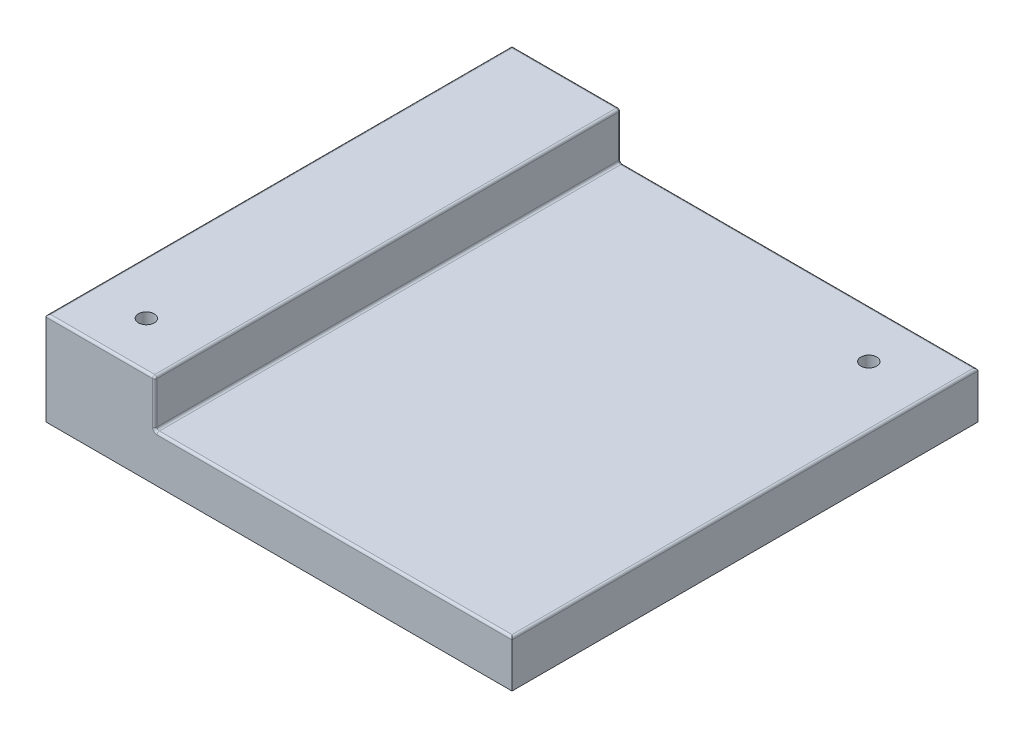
from build123d import *

# Parameters (mm, degrees)
EXTRUDE1_DEPTH     = 762
FILLET1_R          = 7.62
SHELL1_T           = -38.1
SKETCH2_R          = 25.897707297
CUT_EXTRUDE1_DEPTH = 1731.9312638


with BuildPart() as part:
    # Sketch1 → Extrude1 (new, symmetric)
    with BuildSketch(Plane.XY):
        Polygon((0, 0), (0, 304.8), (355.6, 304.8), (355.6, 152.4), (1524, 152.4), (1524, 0), align=None)
    extrude(amount=EXTRUDE1_DEPTH, both=True)

    # Fillet1
    fillet1_edges = [part.edges().sort_by_distance(p)[0] for p in [
        (939.8, 152.4, 762),
        (355.6, 304.8, 0),
        (355.6, 152.4, 0),
        (1524, 152.4, 0),
        (355.6, 228.6, 762),
        (177.8, 304.8, 762),
        (177.8, 304.8, -762),
        (355.6, 228.6, -762),
        (939.8, 152.4, -762),
        (0, 304.8, 0),
    ]]
    fillet(fillet1_edges, radius=FILLET1_R)

    # Shell1
    shell1_openings = [part.faces().sort_by_distance(p)[0] for p in [
        (762, 0, 0),
    ]]
    offset(amount=SHELL1_T, openings=shell1_openings, kind=Kind.INTERSECTION)

    # Sketch2 → Cut-Extrude1 (cut, through all)
    with BuildSketch(Plane(origin=(0, 304.8, 0), x_dir=(1, 0, 0), z_dir=(0, 1, 0))):
        with Locations(Location((175.248210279, -609.021753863, 0), (0, 0, 270))):
            Circle(SKETCH2_R)
        with Locations(Location((1326.496002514, 602.312806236, 0), (0, 0, 270))):
            Circle(SKETCH2_R)
    extrude(amount=-CUT_EXTRUDE1_DEPTH, mode=Mode.SUBTRACT)


solid = part.part
